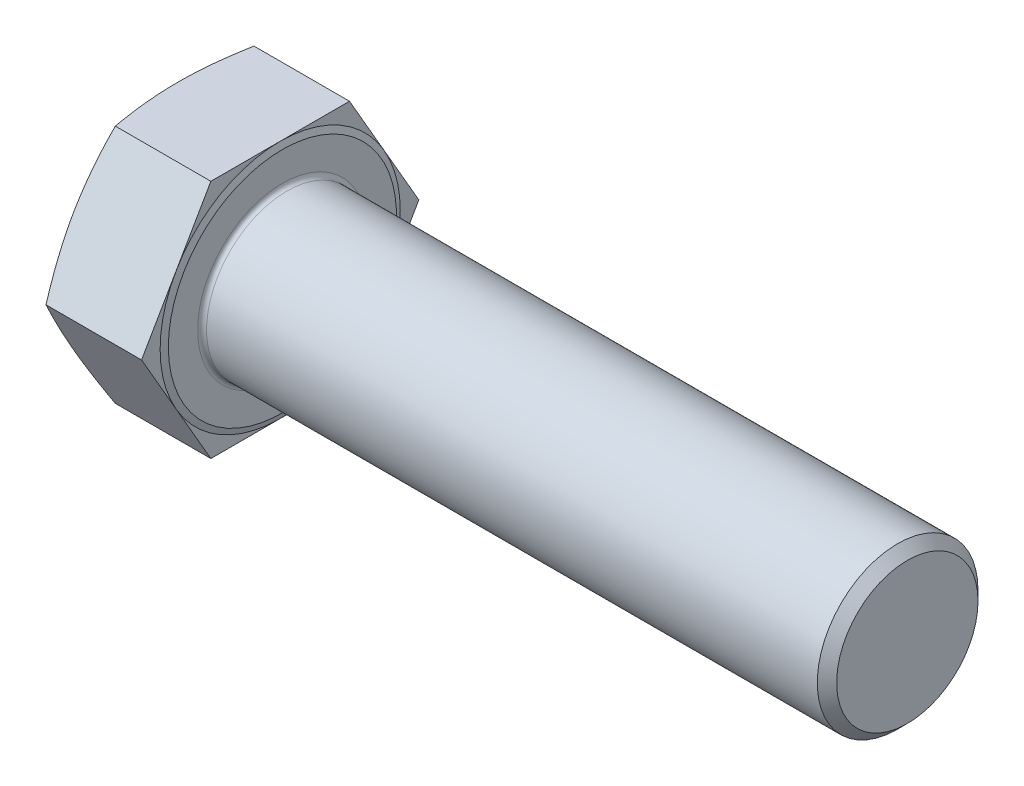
from build123d import *

# Parameters (mm, degrees)
BASEHEAD_DEPTH = 22.92
SKETCH3_R      = 18
BASEBODY_DEPTH = 140
HEADFILLET_R   = 1
CHAMFER1_SIZE  = 2.165


with BuildPart() as part:
    # Sketch-BaseHead → BaseHead (new body)
    with BuildSketch(Plane(origin=(0, 0, 0), x_dir=(0, 0, -1), z_dir=(1, 0, 0))):
        Polygon((31.061444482, 0), (15.530722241, 26.9), (-15.530722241, 26.9), (-31.061444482, 0), (-15.530722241, -26.9), (15.530722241, -26.9), align=None)
    extrude(amount=BASEHEAD_DEPTH)

    # Sketch4 → HeadChamfer (revolve, cut)
    with BuildSketch(Plane(origin=(-0.264637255, 0, 5.916896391), x_dir=(0, 0, -1), z_dir=(0, 1, 0))):
        Polygon((36.978340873, -0.264637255), (32.816896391, -0.264637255), (36.978340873, -1.779279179), align=None)
    revolve(axis=Axis((-4.001564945, 0, 0), (1, 0, 0)), mode=Mode.SUBTRACT)

    # Sketch1 → Revolve1 (revolve)
    with BuildSketch(Plane.XY, mode=Mode.PRIVATE) as revolve1_sk:
        Polygon((22.92, 0), (23.42, 0), (23.42, -25.555), (22.92, -26.9), align=None)
    revolve(revolve1_sk.sketch.rotate(Axis((-4.001564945, 0, 0), (1, 0, 0)), 270), axis=Axis((-4.001564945, 0, 0), (1, 0, 0)))

    # Sketch3 → BaseBody (add)
    with BuildSketch(Plane(origin=(23.42, 0, 0), x_dir=(0, 0, -1), z_dir=(1, 0, 0))):
        Circle(SKETCH3_R)
    extrude(amount=BASEBODY_DEPTH)

    # HeadFillet
    headfillet_edges = [part.edges().sort_by_distance(p)[0] for p in [
        (23.42, 0, 18),
    ]]
    fillet(headfillet_edges, radius=HEADFILLET_R)

    # Chamfer1
    chamfer1_edges = [part.edges().sort_by_distance(p)[0] for p in [
        (163.42, 0, 18),
    ]]
    chamfer(chamfer1_edges, length=CHAMFER1_SIZE)


solid = part.part
